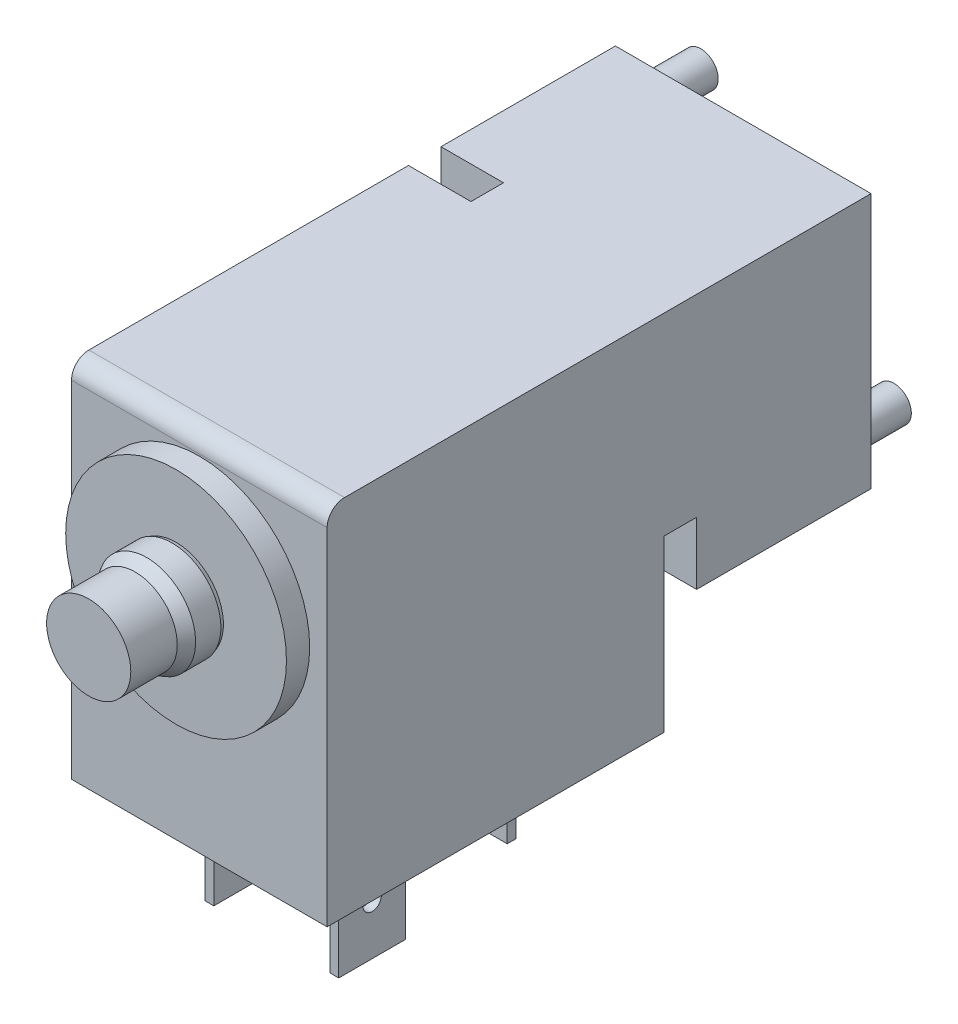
ISO-10303-21;
HEADER;
FILE_DESCRIPTION(('STEP AP214'),'2;1');
FILE_NAME('part.step','',(''),(''),'','','');
FILE_SCHEMA(('AUTOMOTIVE_DESIGN { 1 0 10303 214 1 1 1 1 }'));
ENDSEC;
DATA;
#1=APPLICATION_CONTEXT('core data for automotive mechanical design processes');
#2=APPLICATION_PROTOCOL_DEFINITION('international standard','automotive_design',2000,#1);
#3=PRODUCT_CONTEXT('',#1,'mechanical');
#4=PRODUCT('Part','Part','',(#3));
#5=PRODUCT_RELATED_PRODUCT_CATEGORY('part','',(#4));
#6=PRODUCT_DEFINITION_FORMATION('','',#4);
#7=PRODUCT_DEFINITION_CONTEXT('part definition',#1,'design');
#8=PRODUCT_DEFINITION('design','',#6,#7);
#9=PRODUCT_DEFINITION_SHAPE('','',#8);
#10=(LENGTH_UNIT() NAMED_UNIT(*) SI_UNIT(.MILLI.,.METRE.));
#11=(NAMED_UNIT(*) PLANE_ANGLE_UNIT() SI_UNIT($,.RADIAN.));
#12=(NAMED_UNIT(*) SI_UNIT($,.STERADIAN.) SOLID_ANGLE_UNIT());
#13=UNCERTAINTY_MEASURE_WITH_UNIT(LENGTH_MEASURE(1.E-05),#10,'distance_accuracy_value','');
#14=(GEOMETRIC_REPRESENTATION_CONTEXT(3) GLOBAL_UNCERTAINTY_ASSIGNED_CONTEXT((#13)) GLOBAL_UNIT_ASSIGNED_CONTEXT((#10,
#11,#12)) REPRESENTATION_CONTEXT('',''));
#15=CARTESIAN_POINT('',(0.,0.,0.));
#16=DIRECTION('',(0.,0.,1.));
#17=DIRECTION('',(1.,0.,0.));
#18=AXIS2_PLACEMENT_3D('',#15,#16,#17);
#19=CARTESIAN_POINT('',(11.,14.9150729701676,48.8100000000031));
#20=DIRECTION('',(0.,0.,-1.));
#21=DIRECTION('',(-1.,0.,0.));
#22=AXIS2_PLACEMENT_3D('',#19,#20,#21);
#23=PLANE('',#22);
#24=CARTESIAN_POINT('',(11.,10.8400000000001,48.8100000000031));
#25=DIRECTION('',(0.,0.,-1.));
#26=DIRECTION('',(-1.,0.,0.));
#27=AXIS2_PLACEMENT_3D('',#24,#25,#26);
#28=CIRCLE('',#27,4.07507297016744);
#29=CARTESIAN_POINT('',(6.92492702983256,10.8400000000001,48.8100000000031));
#30=VERTEX_POINT('',#29);
#31=EDGE_CURVE('P0_E9',#30,#30,#28,.T.);
#32=ORIENTED_EDGE('',*,*,#31,.T.);
#33=EDGE_LOOP('',(#32));
#34=FACE_BOUND('',#33,.T.);
#35=ADVANCED_FACE('P0_F14',(#34),#23,.T.);
#36=CARTESIAN_POINT('',(11.,10.8400000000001,48.8100000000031));
#37=DIRECTION('',(0.,0.,1.));
#38=DIRECTION('',(1.,0.,0.));
#39=AXIS2_PLACEMENT_3D('',#36,#37,#38);
#40=CONICAL_SURFACE('',#39,4.07507297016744,0.349065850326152);
#41=CARTESIAN_POINT('',(11.,10.8400000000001,49.1532341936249));
#42=DIRECTION('',(0.,0.,-1.));
#43=DIRECTION('',(-1.,0.,0.));
#44=AXIS2_PLACEMENT_3D('',#41,#42,#43);
#45=CIRCLE('',#44,4.19999999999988);
#46=CARTESIAN_POINT('',(6.80000000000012,10.8400000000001,49.1532341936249));
#47=VERTEX_POINT('',#46);
#48=EDGE_CURVE('P0_E20',#47,#47,#45,.T.);
#49=ORIENTED_EDGE('',*,*,#48,.T.);
#50=EDGE_LOOP('',(#49));
#51=FACE_BOUND('',#50,.T.);
#52=ORIENTED_EDGE('',*,*,#31,.F.);
#53=EDGE_LOOP('',(#52));
#54=FACE_BOUND('',#53,.T.);
#55=ADVANCED_FACE('P0_F54',(#51,#54),#40,.T.);
#56=CARTESIAN_POINT('',(11.,10.8400000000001,45.7723013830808));
#57=DIRECTION('',(0.,0.,-1.));
#58=DIRECTION('',(-1.,0.,0.));
#59=AXIS2_PLACEMENT_3D('',#56,#57,#58);
#60=CYLINDRICAL_SURFACE('',#59,4.19999999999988);
#61=CARTESIAN_POINT('',(11.,10.8400000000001,51.33));
#62=DIRECTION('',(0.,0.,-1.));
#63=DIRECTION('',(-1.,0.,0.));
#64=AXIS2_PLACEMENT_3D('',#61,#62,#63);
#65=CIRCLE('',#64,4.19999999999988);
#66=CARTESIAN_POINT('',(6.80000000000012,10.8400000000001,51.33));
#67=VERTEX_POINT('',#66);
#68=EDGE_CURVE('P0_E24',#67,#67,#65,.T.);
#69=ORIENTED_EDGE('',*,*,#68,.T.);
#70=EDGE_LOOP('',(#69));
#71=FACE_BOUND('',#70,.T.);
#72=ORIENTED_EDGE('',*,*,#48,.F.);
#73=EDGE_LOOP('',(#72));
#74=FACE_BOUND('',#73,.T.);
#75=ADVANCED_FACE('P0_F48',(#71,#74),#60,.T.);
#76=CARTESIAN_POINT('',(11.,10.8400000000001,51.33));
#77=DIRECTION('',(0.,0.,-1.));
#78=DIRECTION('',(-1.,0.,0.));
#79=AXIS2_PLACEMENT_3D('',#76,#77,#78);
#80=CONICAL_SURFACE('',#79,4.19999999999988,0.523598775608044);
#81=CARTESIAN_POINT('',(11.,10.8400000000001,52.3300000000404));
#82=DIRECTION('',(0.,0.,1.));
#83=DIRECTION('',(1.,0.,0.));
#84=AXIS2_PLACEMENT_3D('',#81,#82,#83);
#85=CIRCLE('',#84,3.62264973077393);
#86=CARTESIAN_POINT('',(14.6226497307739,10.8400000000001,52.3300000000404));
#87=VERTEX_POINT('',#86);
#88=EDGE_CURVE('P0_E31',#87,#87,#85,.T.);
#89=ORIENTED_EDGE('',*,*,#88,.F.);
#90=EDGE_LOOP('',(#89));
#91=FACE_BOUND('',#90,.T.);
#92=ORIENTED_EDGE('',*,*,#68,.F.);
#93=EDGE_LOOP('',(#92));
#94=FACE_BOUND('',#93,.T.);
#95=ADVANCED_FACE('P0_F42',(#91,#94),#80,.T.);
#96=CARTESIAN_POINT('',(11.,10.8400000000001,56.3300000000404));
#97=DIRECTION('',(0.,0.,-1.));
#98=DIRECTION('',(-1.,0.,0.));
#99=AXIS2_PLACEMENT_3D('',#96,#97,#98);
#100=CYLINDRICAL_SURFACE('',#99,3.62264973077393);
#101=CARTESIAN_POINT('',(11.,10.8400000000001,56.3300000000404));
#102=DIRECTION('',(0.,0.,1.));
#103=DIRECTION('',(1.,0.,0.));
#104=AXIS2_PLACEMENT_3D('',#101,#102,#103);
#105=CIRCLE('',#104,3.62264973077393);
#106=CARTESIAN_POINT('',(14.6226497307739,10.8400000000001,56.3300000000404));
#107=VERTEX_POINT('',#106);
#108=EDGE_CURVE('P0_E28',#107,#107,#105,.T.);
#109=ORIENTED_EDGE('',*,*,#108,.F.);
#110=EDGE_LOOP('',(#109));
#111=FACE_BOUND('',#110,.T.);
#112=ORIENTED_EDGE('',*,*,#88,.T.);
#113=EDGE_LOOP('',(#112));
#114=FACE_BOUND('',#113,.T.);
#115=ADVANCED_FACE('P0_F39',(#111,#114),#100,.T.);
#116=CARTESIAN_POINT('',(11.,10.8400000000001,56.3300000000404));
#117=DIRECTION('',(0.,0.,1.));
#118=DIRECTION('',(1.,0.,0.));
#119=AXIS2_PLACEMENT_3D('',#116,#117,#118);
#120=PLANE('',#119);
#121=ORIENTED_EDGE('',*,*,#108,.T.);
#122=EDGE_LOOP('',(#121));
#123=FACE_BOUND('',#122,.T.);
#124=ADVANCED_FACE('P0_F37',(#123),#120,.T.);
#125=CLOSED_SHELL('',(#35,#55,#75,#95,#115,#124));
#126=MANIFOLD_SOLID_BREP('P0_B1',#125);
#127=CARTESIAN_POINT('',(13.4999999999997,-6.74999999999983,31.8099999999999));
#128=DIRECTION('',(0.,-1.,0.));
#129=DIRECTION('',(1.,0.,0.));
#130=AXIS2_PLACEMENT_3D('',#127,#128,#129);
#131=PLANE('',#130);
#132=CARTESIAN_POINT('',(10.9999999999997,-6.74999999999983,31.8099999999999));
#133=DIRECTION('',(0.,1.,0.));
#134=DIRECTION('',(-1.,0.,0.));
#135=AXIS2_PLACEMENT_3D('',#132,#133,#134);
#136=CIRCLE('',#135,2.5);
#137=CARTESIAN_POINT('',(8.49999999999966,-6.74999999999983,31.8099999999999));
#138=VERTEX_POINT('',#137);
#139=EDGE_CURVE('P1_E20',#138,#138,#136,.F.);
#140=ORIENTED_EDGE('',*,*,#139,.T.);
#141=EDGE_LOOP('',(#140));
#142=FACE_BOUND('',#141,.T.);
#143=ADVANCED_FACE('P1_F17',(#142),#131,.T.);
#144=CARTESIAN_POINT('',(10.9999999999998,-14.5043798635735,22.5600000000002));
#145=DIRECTION('',(0.,0.,1.));
#146=DIRECTION('',(1.,0.,0.));
#147=AXIS2_PLACEMENT_3D('',#144,#145,#146);
#148=CYLINDRICAL_SURFACE('',#147,0.79);
#149=CARTESIAN_POINT('',(10.9999999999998,-14.5043798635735,22.5600000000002));
#150=DIRECTION('',(0.,0.,1.));
#151=DIRECTION('',(1.,0.,0.));
#152=AXIS2_PLACEMENT_3D('',#149,#150,#151);
#153=CIRCLE('',#152,0.79);
#154=CARTESIAN_POINT('',(11.7899999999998,-14.5043798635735,22.5600000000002));
#155=VERTEX_POINT('',#154);
#156=EDGE_CURVE('P1_E439',#155,#155,#153,.T.);
#157=ORIENTED_EDGE('',*,*,#156,.F.);
#158=EDGE_LOOP('',(#157));
#159=FACE_BOUND('',#158,.T.);
#160=CARTESIAN_POINT('',(10.9999999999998,-14.5043798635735,23.3100000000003));
#161=DIRECTION('',(0.,0.,1.));
#162=DIRECTION('',(1.,0.,0.));
#163=AXIS2_PLACEMENT_3D('',#160,#161,#162);
#164=CIRCLE('',#163,0.79);
#165=CARTESIAN_POINT('',(11.7899999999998,-14.5043798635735,23.3100000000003));
#166=VERTEX_POINT('',#165);
#167=EDGE_CURVE('P1_E443',#166,#166,#164,.F.);
#168=ORIENTED_EDGE('',*,*,#167,.F.);
#169=EDGE_LOOP('',(#168));
#170=FACE_BOUND('',#169,.T.);
#171=ADVANCED_FACE('P1_F725',(#159,#170),#148,.F.);
#172=CARTESIAN_POINT('',(7.99999999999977,-18.8099999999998,23.3100000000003));
#173=DIRECTION('',(0.,1.,0.));
#174=DIRECTION('',(0.,0.,1.));
#175=AXIS2_PLACEMENT_3D('',#172,#173,#174);
#176=PLANE('',#175);
#177=DIRECTION('',(0.,0.,1.));
#178=VECTOR('',#177,1.);
#179=CARTESIAN_POINT('',(7.99999999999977,-18.8099999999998,22.5600000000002));
#180=LINE('',#179,#178);
#181=CARTESIAN_POINT('',(7.99999999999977,-18.8099999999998,22.5600000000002));
#182=VERTEX_POINT('',#181);
#183=CARTESIAN_POINT('',(7.99999999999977,-18.8099999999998,23.3100000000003));
#184=VERTEX_POINT('',#183);
#185=EDGE_CURVE('P1_E393',#182,#184,#180,.T.);
#186=ORIENTED_EDGE('',*,*,#185,.F.);
#187=DIRECTION('',(-1.,0.,0.));
#188=VECTOR('',#187,1.);
#189=CARTESIAN_POINT('',(8.24999999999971,-18.8099999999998,22.5600000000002));
#190=LINE('',#189,#188);
#191=CARTESIAN_POINT('',(13.9999999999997,-18.8099999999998,22.5600000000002));
#192=VERTEX_POINT('',#191);
#193=EDGE_CURVE('P1_E441',#192,#182,#190,.T.);
#194=ORIENTED_EDGE('',*,*,#193,.F.);
#195=DIRECTION('',(0.,0.,1.));
#196=VECTOR('',#195,1.);
#197=CARTESIAN_POINT('',(13.9999999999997,-18.8099999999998,23.3100000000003));
#198=LINE('',#197,#196);
#199=CARTESIAN_POINT('',(13.9999999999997,-18.8099999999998,23.3100000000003));
#200=VERTEX_POINT('',#199);
#201=EDGE_CURVE('P1_E389',#200,#192,#198,.F.);
#202=ORIENTED_EDGE('',*,*,#201,.F.);
#203=DIRECTION('',(1.,0.,0.));
#204=VECTOR('',#203,1.);
#205=CARTESIAN_POINT('',(10.9999999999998,-18.8099999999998,23.3100000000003));
#206=LINE('',#205,#204);
#207=EDGE_CURVE('P1_E445',#184,#200,#206,.T.);
#208=ORIENTED_EDGE('',*,*,#207,.F.);
#209=EDGE_LOOP('',(#186,#194,#202,#208));
#210=FACE_BOUND('',#209,.T.);
#211=ADVANCED_FACE('P1_F722',(#210),#176,.F.);
#212=CARTESIAN_POINT('',(7.99999999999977,-9.24999999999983,22.5600000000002));
#213=DIRECTION('',(-1.,0.,0.));
#214=DIRECTION('',(0.,-1.,0.));
#215=AXIS2_PLACEMENT_3D('',#212,#213,#214);
#216=PLANE('',#215);
#217=DIRECTION('',(0.,0.,1.));
#218=VECTOR('',#217,1.);
#219=CARTESIAN_POINT('',(7.99999999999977,-9.24999999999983,22.5600000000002));
#220=LINE('',#219,#218);
#221=CARTESIAN_POINT('',(7.99999999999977,-9.24999999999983,23.3100000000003));
#222=VERTEX_POINT('',#221);
#223=CARTESIAN_POINT('',(7.99999999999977,-9.24999999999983,22.5600000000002));
#224=VERTEX_POINT('',#223);
#225=EDGE_CURVE('P1_E391',#222,#224,#220,.F.);
#226=ORIENTED_EDGE('',*,*,#225,.T.);
#227=DIRECTION('',(0.,1.,0.));
#228=VECTOR('',#227,1.);
#229=CARTESIAN_POINT('',(7.99999999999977,-9.24999999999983,22.5600000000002));
#230=LINE('',#229,#228);
#231=EDGE_CURVE('P1_E578',#182,#224,#230,.T.);
#232=ORIENTED_EDGE('',*,*,#231,.F.);
#233=ORIENTED_EDGE('',*,*,#185,.T.);
#234=DIRECTION('',(0.,1.,0.));
#235=VECTOR('',#234,1.);
#236=CARTESIAN_POINT('',(7.99999999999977,-9.24999999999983,23.3100000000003));
#237=LINE('',#236,#235);
#238=EDGE_CURVE('P1_E442',#222,#184,#237,.F.);
#239=ORIENTED_EDGE('',*,*,#238,.F.);
#240=EDGE_LOOP('',(#226,#232,#233,#239));
#241=FACE_BOUND('',#240,.T.);
#242=ADVANCED_FACE('P1_F718',(#241),#216,.T.);
#243=CARTESIAN_POINT('',(13.9999999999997,-9.24999999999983,23.3100000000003));
#244=DIRECTION('',(1.,0.,0.));
#245=DIRECTION('',(0.,1.,0.));
#246=AXIS2_PLACEMENT_3D('',#243,#244,#245);
#247=PLANE('',#246);
#248=DIRECTION('',(0.,0.,1.));
#249=VECTOR('',#248,1.);
#250=CARTESIAN_POINT('',(13.9999999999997,-9.24999999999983,23.3100000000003));
#251=LINE('',#250,#249);
#252=CARTESIAN_POINT('',(13.9999999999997,-9.24999999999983,22.5600000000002));
#253=VERTEX_POINT('',#252);
#254=CARTESIAN_POINT('',(13.9999999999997,-9.24999999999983,23.3100000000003));
#255=VERTEX_POINT('',#254);
#256=EDGE_CURVE('P1_E387',#253,#255,#251,.T.);
#257=ORIENTED_EDGE('',*,*,#256,.T.);
#258=DIRECTION('',(0.,1.,0.));
#259=VECTOR('',#258,1.);
#260=CARTESIAN_POINT('',(13.9999999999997,-9.24999999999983,23.3100000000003));
#261=LINE('',#260,#259);
#262=EDGE_CURVE('P1_E448',#200,#255,#261,.T.);
#263=ORIENTED_EDGE('',*,*,#262,.F.);
#264=ORIENTED_EDGE('',*,*,#201,.T.);
#265=DIRECTION('',(0.,1.,0.));
#266=VECTOR('',#265,1.);
#267=CARTESIAN_POINT('',(13.9999999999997,-9.24999999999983,22.5600000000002));
#268=LINE('',#267,#266);
#269=EDGE_CURVE('P1_E438',#253,#192,#268,.F.);
#270=ORIENTED_EDGE('',*,*,#269,.F.);
#271=EDGE_LOOP('',(#257,#263,#264,#270));
#272=FACE_BOUND('',#271,.T.);
#273=ADVANCED_FACE('P1_F714',(#272),#247,.T.);
#274=CARTESIAN_POINT('',(5.24999999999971,-14.5043798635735,37.6850000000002));
#275=DIRECTION('',(1.,0.,0.));
#276=DIRECTION('',(0.,1.,0.));
#277=AXIS2_PLACEMENT_3D('',#274,#275,#276);
#278=CYLINDRICAL_SURFACE('',#277,0.79);
#279=CARTESIAN_POINT('',(16.7499999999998,-14.5043798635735,37.6850000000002));
#280=DIRECTION('',(1.,0.,0.));
#281=DIRECTION('',(0.,1.,0.));
#282=AXIS2_PLACEMENT_3D('',#279,#280,#281);
#283=CIRCLE('',#282,0.79);
#284=CARTESIAN_POINT('',(16.7499999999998,-13.7143798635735,37.6850000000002));
#285=VERTEX_POINT('',#284);
#286=EDGE_CURVE('P1_E434',#285,#285,#283,.F.);
#287=ORIENTED_EDGE('',*,*,#286,.F.);
#288=EDGE_LOOP('',(#287));
#289=FACE_BOUND('',#288,.T.);
#290=CARTESIAN_POINT('',(15.9999999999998,-14.5043798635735,37.6850000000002));
#291=DIRECTION('',(1.,0.,0.));
#292=DIRECTION('',(0.,1.,0.));
#293=AXIS2_PLACEMENT_3D('',#290,#291,#292);
#294=CIRCLE('',#293,0.79);
#295=CARTESIAN_POINT('',(15.9999999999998,-13.7143798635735,37.6850000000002));
#296=VERTEX_POINT('',#295);
#297=EDGE_CURVE('P1_E429',#296,#296,#294,.T.);
#298=ORIENTED_EDGE('',*,*,#297,.F.);
#299=EDGE_LOOP('',(#298));
#300=FACE_BOUND('',#299,.T.);
#301=ADVANCED_FACE('P1_F710',(#289,#300),#278,.F.);
#302=CARTESIAN_POINT('',(15.9999999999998,-18.8099999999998,40.5600000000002));
#303=DIRECTION('',(0.,1.,0.));
#304=DIRECTION('',(0.,0.,1.));
#305=AXIS2_PLACEMENT_3D('',#302,#303,#304);
#306=PLANE('',#305);
#307=DIRECTION('',(0.,0.,1.));
#308=VECTOR('',#307,1.);
#309=CARTESIAN_POINT('',(15.9999999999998,-18.8099999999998,34.8100000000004));
#310=LINE('',#309,#308);
#311=CARTESIAN_POINT('',(15.9999999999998,-18.8099999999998,34.8100000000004));
#312=VERTEX_POINT('',#311);
#313=CARTESIAN_POINT('',(15.9999999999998,-18.8099999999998,40.5600000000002));
#314=VERTEX_POINT('',#313);
#315=EDGE_CURVE('P1_E432',#312,#314,#310,.T.);
#316=ORIENTED_EDGE('',*,*,#315,.F.);
#317=DIRECTION('',(-1.,0.,0.));
#318=VECTOR('',#317,1.);
#319=CARTESIAN_POINT('',(16.7499999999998,-18.8099999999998,34.8100000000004));
#320=LINE('',#319,#318);
#321=CARTESIAN_POINT('',(16.7499999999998,-18.8099999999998,34.8100000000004));
#322=VERTEX_POINT('',#321);
#323=EDGE_CURVE('P1_E381',#322,#312,#320,.T.);
#324=ORIENTED_EDGE('',*,*,#323,.F.);
#325=DIRECTION('',(0.,0.,1.));
#326=VECTOR('',#325,1.);
#327=CARTESIAN_POINT('',(16.7499999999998,-18.8099999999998,40.5600000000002));
#328=LINE('',#327,#326);
#329=CARTESIAN_POINT('',(16.7499999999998,-18.8099999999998,40.5600000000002));
#330=VERTEX_POINT('',#329);
#331=EDGE_CURVE('P1_E437',#330,#322,#328,.F.);
#332=ORIENTED_EDGE('',*,*,#331,.F.);
#333=DIRECTION('',(1.,0.,0.));
#334=VECTOR('',#333,1.);
#335=CARTESIAN_POINT('',(15.9999999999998,-18.8099999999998,40.5600000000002));
#336=LINE('',#335,#334);
#337=EDGE_CURVE('P1_E385',#314,#330,#336,.T.);
#338=ORIENTED_EDGE('',*,*,#337,.F.);
#339=EDGE_LOOP('',(#316,#324,#332,#338));
#340=FACE_BOUND('',#339,.T.);
#341=ADVANCED_FACE('P1_F706',(#340),#306,.F.);
#342=CARTESIAN_POINT('',(15.9999999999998,-9.24999999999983,40.5600000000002));
#343=DIRECTION('',(0.,0.,1.));
#344=DIRECTION('',(1.,0.,0.));
#345=AXIS2_PLACEMENT_3D('',#342,#343,#344);
#346=PLANE('',#345);
#347=DIRECTION('',(1.,0.,0.));
#348=VECTOR('',#347,1.);
#349=CARTESIAN_POINT('',(15.9999999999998,-9.24999999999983,40.5600000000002));
#350=LINE('',#349,#348);
#351=CARTESIAN_POINT('',(16.7499999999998,-9.24999999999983,40.5600000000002));
#352=VERTEX_POINT('',#351);
#353=CARTESIAN_POINT('',(15.9999999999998,-9.24999999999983,40.5600000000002));
#354=VERTEX_POINT('',#353);
#355=EDGE_CURVE('P1_E383',#352,#354,#350,.F.);
#356=ORIENTED_EDGE('',*,*,#355,.T.);
#357=DIRECTION('',(0.,-1.,0.));
#358=VECTOR('',#357,1.);
#359=CARTESIAN_POINT('',(15.9999999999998,-9.24999999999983,40.5600000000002));
#360=LINE('',#359,#358);
#361=EDGE_CURVE('P1_E590',#314,#354,#360,.F.);
#362=ORIENTED_EDGE('',*,*,#361,.F.);
#363=ORIENTED_EDGE('',*,*,#337,.T.);
#364=DIRECTION('',(0.,1.,0.));
#365=VECTOR('',#364,1.);
#366=CARTESIAN_POINT('',(16.7499999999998,-9.24999999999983,40.5600000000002));
#367=LINE('',#366,#365);
#368=EDGE_CURVE('P1_E433',#352,#330,#367,.F.);
#369=ORIENTED_EDGE('',*,*,#368,.F.);
#370=EDGE_LOOP('',(#356,#362,#363,#369));
#371=FACE_BOUND('',#370,.T.);
#372=ADVANCED_FACE('P1_F702',(#371),#346,.T.);
#373=CARTESIAN_POINT('',(16.7499999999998,-9.24999999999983,34.8100000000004));
#374=DIRECTION('',(0.,0.,-1.));
#375=DIRECTION('',(-1.,0.,0.));
#376=AXIS2_PLACEMENT_3D('',#373,#374,#375);
#377=PLANE('',#376);
#378=DIRECTION('',(-1.,0.,0.));
#379=VECTOR('',#378,1.);
#380=CARTESIAN_POINT('',(16.7499999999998,-9.24999999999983,34.8100000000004));
#381=LINE('',#380,#379);
#382=CARTESIAN_POINT('',(15.9999999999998,-9.24999999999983,34.8100000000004));
#383=VERTEX_POINT('',#382);
#384=CARTESIAN_POINT('',(16.7499999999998,-9.24999999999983,34.8100000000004));
#385=VERTEX_POINT('',#384);
#386=EDGE_CURVE('P1_E379',#383,#385,#381,.F.);
#387=ORIENTED_EDGE('',*,*,#386,.T.);
#388=DIRECTION('',(0.,1.,0.));
#389=VECTOR('',#388,1.);
#390=CARTESIAN_POINT('',(16.7499999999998,-9.24999999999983,34.8100000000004));
#391=LINE('',#390,#389);
#392=EDGE_CURVE('P1_E584',#322,#385,#391,.T.);
#393=ORIENTED_EDGE('',*,*,#392,.F.);
#394=ORIENTED_EDGE('',*,*,#323,.T.);
#395=DIRECTION('',(0.,-1.,0.));
#396=VECTOR('',#395,1.);
#397=CARTESIAN_POINT('',(15.9999999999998,-9.24999999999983,34.8100000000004));
#398=LINE('',#397,#396);
#399=EDGE_CURVE('P1_E428',#383,#312,#398,.T.);
#400=ORIENTED_EDGE('',*,*,#399,.F.);
#401=EDGE_LOOP('',(#387,#393,#394,#400));
#402=FACE_BOUND('',#401,.T.);
#403=ADVANCED_FACE('P1_F698',(#402),#377,.T.);
#404=CARTESIAN_POINT('',(5.24999999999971,-14.5043798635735,37.6850000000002));
#405=DIRECTION('',(1.,0.,0.));
#406=DIRECTION('',(0.,1.,0.));
#407=AXIS2_PLACEMENT_3D('',#404,#405,#406);
#408=CYLINDRICAL_SURFACE('',#407,0.79);
#409=CARTESIAN_POINT('',(5.24999999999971,-14.5043798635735,37.6850000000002));
#410=DIRECTION('',(1.,0.,0.));
#411=DIRECTION('',(0.,1.,0.));
#412=AXIS2_PLACEMENT_3D('',#409,#410,#411);
#413=CIRCLE('',#412,0.79);
#414=CARTESIAN_POINT('',(5.24999999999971,-13.7143798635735,37.6850000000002));
#415=VERTEX_POINT('',#414);
#416=EDGE_CURVE('P1_E424',#415,#415,#413,.T.);
#417=ORIENTED_EDGE('',*,*,#416,.F.);
#418=EDGE_LOOP('',(#417));
#419=FACE_BOUND('',#418,.T.);
#420=CARTESIAN_POINT('',(5.99999999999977,-14.5043798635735,37.6850000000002));
#421=DIRECTION('',(1.,0.,0.));
#422=DIRECTION('',(0.,1.,0.));
#423=AXIS2_PLACEMENT_3D('',#420,#421,#422);
#424=CIRCLE('',#423,0.79);
#425=CARTESIAN_POINT('',(5.99999999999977,-13.7143798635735,37.6850000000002));
#426=VERTEX_POINT('',#425);
#427=EDGE_CURVE('P1_E419',#426,#426,#424,.F.);
#428=ORIENTED_EDGE('',*,*,#427,.F.);
#429=EDGE_LOOP('',(#428));
#430=FACE_BOUND('',#429,.T.);
#431=ADVANCED_FACE('P1_F694',(#419,#430),#408,.F.);
#432=CARTESIAN_POINT('',(5.24999999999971,-18.8099999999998,34.8100000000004));
#433=DIRECTION('',(0.,-1.,0.));
#434=DIRECTION('',(1.,0.,0.));
#435=AXIS2_PLACEMENT_3D('',#432,#433,#434);
#436=PLANE('',#435);
#437=DIRECTION('',(0.,0.,1.));
#438=VECTOR('',#437,1.);
#439=CARTESIAN_POINT('',(5.99999999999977,-18.8099999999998,40.5600000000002));
#440=LINE('',#439,#438);
#441=CARTESIAN_POINT('',(5.99999999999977,-18.8099999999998,40.5600000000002));
#442=VERTEX_POINT('',#441);
#443=CARTESIAN_POINT('',(5.99999999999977,-18.8099999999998,34.8100000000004));
#444=VERTEX_POINT('',#443);
#445=EDGE_CURVE('P1_E422',#442,#444,#440,.F.);
#446=ORIENTED_EDGE('',*,*,#445,.F.);
#447=DIRECTION('',(1.,0.,0.));
#448=VECTOR('',#447,1.);
#449=CARTESIAN_POINT('',(5.24999999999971,-18.8099999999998,40.5600000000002));
#450=LINE('',#449,#448);
#451=CARTESIAN_POINT('',(5.24999999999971,-18.8099999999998,40.5600000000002));
#452=VERTEX_POINT('',#451);
#453=EDGE_CURVE('P1_E373',#452,#442,#450,.T.);
#454=ORIENTED_EDGE('',*,*,#453,.F.);
#455=DIRECTION('',(0.,0.,1.));
#456=VECTOR('',#455,1.);
#457=CARTESIAN_POINT('',(5.24999999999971,-18.8099999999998,34.8100000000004));
#458=LINE('',#457,#456);
#459=CARTESIAN_POINT('',(5.24999999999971,-18.8099999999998,34.8100000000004));
#460=VERTEX_POINT('',#459);
#461=EDGE_CURVE('P1_E427',#460,#452,#458,.T.);
#462=ORIENTED_EDGE('',*,*,#461,.F.);
#463=DIRECTION('',(-1.,0.,0.));
#464=VECTOR('',#463,1.);
#465=CARTESIAN_POINT('',(5.99999999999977,-18.8099999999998,34.8100000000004));
#466=LINE('',#465,#464);
#467=EDGE_CURVE('P1_E377',#444,#460,#466,.T.);
#468=ORIENTED_EDGE('',*,*,#467,.F.);
#469=EDGE_LOOP('',(#446,#454,#462,#468));
#470=FACE_BOUND('',#469,.T.);
#471=ADVANCED_FACE('P1_F688',(#470),#436,.T.);
#472=CARTESIAN_POINT('',(5.99999999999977,-9.24999999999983,34.8100000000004));
#473=DIRECTION('',(0.,0.,-1.));
#474=DIRECTION('',(-1.,0.,0.));
#475=AXIS2_PLACEMENT_3D('',#472,#473,#474);
#476=PLANE('',#475);
#477=DIRECTION('',(-1.,0.,0.));
#478=VECTOR('',#477,1.);
#479=CARTESIAN_POINT('',(5.99999999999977,-9.24999999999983,34.8100000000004));
#480=LINE('',#479,#478);
#481=CARTESIAN_POINT('',(5.24999999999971,-9.24999999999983,34.8100000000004));
#482=VERTEX_POINT('',#481);
#483=CARTESIAN_POINT('',(5.99999999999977,-9.24999999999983,34.8100000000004));
#484=VERTEX_POINT('',#483);
#485=EDGE_CURVE('P1_E375',#482,#484,#480,.F.);
#486=ORIENTED_EDGE('',*,*,#485,.T.);
#487=DIRECTION('',(0.,1.,0.));
#488=VECTOR('',#487,1.);
#489=CARTESIAN_POINT('',(5.99999999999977,-9.24999999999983,34.8100000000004));
#490=LINE('',#489,#488);
#491=EDGE_CURVE('P1_E602',#444,#484,#490,.T.);
#492=ORIENTED_EDGE('',*,*,#491,.F.);
#493=ORIENTED_EDGE('',*,*,#467,.T.);
#494=DIRECTION('',(0.,-1.,0.));
#495=VECTOR('',#494,1.);
#496=CARTESIAN_POINT('',(5.24999999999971,-9.24999999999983,34.8100000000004));
#497=LINE('',#496,#495);
#498=EDGE_CURVE('P1_E423',#482,#460,#497,.T.);
#499=ORIENTED_EDGE('',*,*,#498,.F.);
#500=EDGE_LOOP('',(#486,#492,#493,#499));
#501=FACE_BOUND('',#500,.T.);
#502=ADVANCED_FACE('P1_F683',(#501),#476,.T.);
#503=CARTESIAN_POINT('',(5.24999999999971,-9.24999999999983,40.5600000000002));
#504=DIRECTION('',(0.,0.,1.));
#505=DIRECTION('',(1.,0.,0.));
#506=AXIS2_PLACEMENT_3D('',#503,#504,#505);
#507=PLANE('',#506);
#508=DIRECTION('',(1.,0.,0.));
#509=VECTOR('',#508,1.);
#510=CARTESIAN_POINT('',(5.24999999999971,-9.24999999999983,40.5600000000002));
#511=LINE('',#510,#509);
#512=CARTESIAN_POINT('',(5.99999999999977,-9.24999999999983,40.5600000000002));
#513=VERTEX_POINT('',#512);
#514=CARTESIAN_POINT('',(5.24999999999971,-9.24999999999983,40.5600000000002));
#515=VERTEX_POINT('',#514);
#516=EDGE_CURVE('P1_E371',#513,#515,#511,.F.);
#517=ORIENTED_EDGE('',*,*,#516,.T.);
#518=DIRECTION('',(0.,-1.,0.));
#519=VECTOR('',#518,1.);
#520=CARTESIAN_POINT('',(5.24999999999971,-9.24999999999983,40.5600000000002));
#521=LINE('',#520,#519);
#522=EDGE_CURVE('P1_E596',#452,#515,#521,.F.);
#523=ORIENTED_EDGE('',*,*,#522,.F.);
#524=ORIENTED_EDGE('',*,*,#453,.T.);
#525=DIRECTION('',(0.,1.,0.));
#526=VECTOR('',#525,1.);
#527=CARTESIAN_POINT('',(5.99999999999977,-9.24999999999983,40.5600000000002));
#528=LINE('',#527,#526);
#529=EDGE_CURVE('P1_E418',#513,#442,#528,.F.);
#530=ORIENTED_EDGE('',*,*,#529,.F.);
#531=EDGE_LOOP('',(#517,#523,#524,#530));
#532=FACE_BOUND('',#531,.T.);
#533=ADVANCED_FACE('P1_F679',(#532),#507,.T.);
#534=CARTESIAN_POINT('',(11.,17.6275364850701,48.8099999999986));
#535=DIRECTION('',(0.,0.,1.));
#536=DIRECTION('',(1.,0.,0.));
#537=AXIS2_PLACEMENT_3D('',#534,#535,#536);
#538=PLANE('',#537);
#539=CARTESIAN_POINT('',(11.,10.8400000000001,48.8099999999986));
#540=DIRECTION('',(0.,0.,-1.));
#541=DIRECTION('',(-1.,0.,0.));
#542=AXIS2_PLACEMENT_3D('',#539,#540,#541);
#543=CIRCLE('',#542,9.5);
#544=CARTESIAN_POINT('',(1.5,10.8400000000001,48.8099999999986));
#545=VERTEX_POINT('',#544);
#546=EDGE_CURVE('P1_E415',#545,#545,#543,.T.);
#547=ORIENTED_EDGE('',*,*,#546,.F.);
#548=EDGE_LOOP('',(#547));
#549=FACE_BOUND('',#548,.T.);
#550=ADVANCED_FACE('P1_F547',(#549),#538,.T.);
#551=CARTESIAN_POINT('',(11.,6.97044066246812,-0.371580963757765));
#552=DIRECTION('',(0.,0.,-1.));
#553=DIRECTION('',(-1.,0.,0.));
#554=AXIS2_PLACEMENT_3D('',#551,#552,#553);
#555=PLANE('',#554);
#556=CARTESIAN_POINT('',(11.,11.0000000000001,-0.371580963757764));
#557=DIRECTION('',(0.,0.,1.));
#558=DIRECTION('',(0.,-1.,0.));
#559=AXIS2_PLACEMENT_3D('',#556,#557,#558);
#560=CIRCLE('',#559,8.05911867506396);
#561=CARTESIAN_POINT('',(11.,2.94088132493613,-0.371580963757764));
#562=VERTEX_POINT('',#561);
#563=EDGE_CURVE('P1_E414',#562,#562,#560,.T.);
#564=ORIENTED_EDGE('',*,*,#563,.F.);
#565=EDGE_LOOP('',(#564));
#566=FACE_BOUND('',#565,.T.);
#567=ADVANCED_FACE('P1_F540',(#566),#555,.T.);
#568=CARTESIAN_POINT('',(2.69000000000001,17.8100000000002,-4.66));
#569=DIRECTION('',(0.,0.,1.));
#570=DIRECTION('',(1.,0.,0.));
#571=AXIS2_PLACEMENT_3D('',#568,#569,#570);
#572=PLANE('',#571);
#573=CARTESIAN_POINT('',(2.69000000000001,19.3100000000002,-4.66));
#574=DIRECTION('',(0.,0.,-1.));
#575=DIRECTION('',(-1.,0.,0.));
#576=AXIS2_PLACEMENT_3D('',#573,#574,#575);
#577=CIRCLE('',#576,1.5);
#578=CARTESIAN_POINT('',(1.19000000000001,19.3100000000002,-4.66));
#579=VERTEX_POINT('',#578);
#580=EDGE_CURVE('P1_E411',#579,#579,#577,.F.);
#581=ORIENTED_EDGE('',*,*,#580,.F.);
#582=EDGE_LOOP('',(#581));
#583=FACE_BOUND('',#582,.T.);
#584=ADVANCED_FACE('P1_F535',(#583),#572,.F.);
#585=CARTESIAN_POINT('',(19.31,1.19,-4.66));
#586=DIRECTION('',(0.,0.,1.));
#587=DIRECTION('',(1.,0.,0.));
#588=AXIS2_PLACEMENT_3D('',#585,#586,#587);
#589=PLANE('',#588);
#590=CARTESIAN_POINT('',(19.31,2.69,-4.66));
#591=DIRECTION('',(0.,0.,-1.));
#592=DIRECTION('',(-1.,0.,0.));
#593=AXIS2_PLACEMENT_3D('',#590,#591,#592);
#594=CIRCLE('',#593,1.5);
#595=CARTESIAN_POINT('',(17.81,2.69,-4.66));
#596=VERTEX_POINT('',#595);
#597=EDGE_CURVE('P1_E407',#596,#596,#594,.F.);
#598=ORIENTED_EDGE('',*,*,#597,.F.);
#599=EDGE_LOOP('',(#598));
#600=FACE_BOUND('',#599,.T.);
#601=ADVANCED_FACE('P1_F468',(#600),#589,.F.);
#602=CARTESIAN_POINT('',(0.,16.6200000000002,17.81));
#603=DIRECTION('',(0.,-1.,0.));
#604=DIRECTION('',(1.,0.,0.));
#605=AXIS2_PLACEMENT_3D('',#602,#603,#604);
#606=PLANE('',#605);
#607=DIRECTION('',(0.,0.,1.));
#608=VECTOR('',#607,1.);
#609=CARTESIAN_POINT('',(0.,16.6200000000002,8.905));
#610=LINE('',#609,#608);
#611=CARTESIAN_POINT('',(0.,16.6200000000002,15.01));
#612=VERTEX_POINT('',#611);
#613=CARTESIAN_POINT('',(0.,16.6200000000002,17.81));
#614=VERTEX_POINT('',#613);
#615=EDGE_CURVE('P1_E567',#612,#614,#610,.T.);
#616=ORIENTED_EDGE('',*,*,#615,.T.);
#617=DIRECTION('',(-1.,0.,0.));
#618=VECTOR('',#617,1.);
#619=CARTESIAN_POINT('',(0.,16.6200000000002,17.81));
#620=LINE('',#619,#618);
#621=CARTESIAN_POINT('',(5.38,16.6200000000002,17.81));
#622=VERTEX_POINT('',#621);
#623=EDGE_CURVE('P1_E562',#622,#614,#620,.T.);
#624=ORIENTED_EDGE('',*,*,#623,.F.);
#625=DIRECTION('',(0.,0.,1.));
#626=VECTOR('',#625,1.);
#627=CARTESIAN_POINT('',(5.38,16.6200000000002,17.81));
#628=LINE('',#627,#626);
#629=CARTESIAN_POINT('',(5.38,16.6200000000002,15.01));
#630=VERTEX_POINT('',#629);
#631=EDGE_CURVE('P1_E359',#622,#630,#628,.F.);
#632=ORIENTED_EDGE('',*,*,#631,.T.);
#633=DIRECTION('',(-1.,0.,0.));
#634=VECTOR('',#633,1.);
#635=CARTESIAN_POINT('',(0.,16.6200000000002,15.01));
#636=LINE('',#635,#634);
#637=EDGE_CURVE('P1_E368',#630,#612,#636,.T.);
#638=ORIENTED_EDGE('',*,*,#637,.T.);
#639=EDGE_LOOP('',(#616,#624,#632,#638));
#640=FACE_BOUND('',#639,.T.);
#641=ADVANCED_FACE('P1_F457',(#640),#606,.F.);
#642=CARTESIAN_POINT('',(10.9999999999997,-9.24999999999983,31.8099999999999));
#643=DIRECTION('',(0.,1.,0.));
#644=DIRECTION('',(-1.,0.,0.));
#645=AXIS2_PLACEMENT_3D('',#642,#643,#644);
#646=CYLINDRICAL_SURFACE('',#645,2.5);
#647=CARTESIAN_POINT('',(10.9999999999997,-9.24999999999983,31.8099999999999));
#648=DIRECTION('',(0.,1.,0.));
#649=DIRECTION('',(-1.,0.,0.));
#650=AXIS2_PLACEMENT_3D('',#647,#648,#649);
#651=CIRCLE('',#650,2.5);
#652=CARTESIAN_POINT('',(8.49999999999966,-9.24999999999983,31.8099999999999));
#653=VERTEX_POINT('',#652);
#654=EDGE_CURVE('P1_E267',#653,#653,#651,.T.);
#655=ORIENTED_EDGE('',*,*,#654,.F.);
#656=EDGE_LOOP('',(#655));
#657=FACE_BOUND('',#656,.T.);
#658=ORIENTED_EDGE('',*,*,#139,.F.);
#659=EDGE_LOOP('',(#658));
#660=FACE_BOUND('',#659,.T.);
#661=ADVANCED_FACE('P1_F454',(#657,#660),#646,.F.);
#662=CARTESIAN_POINT('',(10.9999999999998,-9.24999999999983,23.3100000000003));
#663=DIRECTION('',(0.,0.,1.));
#664=DIRECTION('',(1.,0.,0.));
#665=AXIS2_PLACEMENT_3D('',#662,#663,#664);
#666=PLANE('',#665);
#667=DIRECTION('',(1.,0.,0.));
#668=VECTOR('',#667,1.);
#669=CARTESIAN_POINT('',(0.,-9.24999999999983,23.3100000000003));
#670=LINE('',#669,#668);
#671=EDGE_CURVE('P1_E264',#222,#255,#670,.T.);
#672=ORIENTED_EDGE('',*,*,#671,.F.);
#673=ORIENTED_EDGE('',*,*,#238,.T.);
#674=ORIENTED_EDGE('',*,*,#207,.T.);
#675=ORIENTED_EDGE('',*,*,#262,.T.);
#676=EDGE_LOOP('',(#672,#673,#674,#675));
#677=FACE_BOUND('',#676,.T.);
#678=ORIENTED_EDGE('',*,*,#167,.T.);
#679=EDGE_LOOP('',(#678));
#680=FACE_BOUND('',#679,.T.);
#681=ADVANCED_FACE('P1_F456',(#677,#680),#666,.T.);
#682=CARTESIAN_POINT('',(8.24999999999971,-9.24999999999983,22.5600000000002));
#683=DIRECTION('',(0.,0.,-1.));
#684=DIRECTION('',(-1.,0.,0.));
#685=AXIS2_PLACEMENT_3D('',#682,#683,#684);
#686=PLANE('',#685);
#687=DIRECTION('',(1.,0.,0.));
#688=VECTOR('',#687,1.);
#689=CARTESIAN_POINT('',(0.,-9.24999999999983,22.5600000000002));
#690=LINE('',#689,#688);
#691=EDGE_CURVE('P1_E261',#253,#224,#690,.F.);
#692=ORIENTED_EDGE('',*,*,#691,.F.);
#693=ORIENTED_EDGE('',*,*,#269,.T.);
#694=ORIENTED_EDGE('',*,*,#193,.T.);
#695=ORIENTED_EDGE('',*,*,#231,.T.);
#696=EDGE_LOOP('',(#692,#693,#694,#695));
#697=FACE_BOUND('',#696,.T.);
#698=ORIENTED_EDGE('',*,*,#156,.T.);
#699=EDGE_LOOP('',(#698));
#700=FACE_BOUND('',#699,.T.);
#701=ADVANCED_FACE('P1_F465',(#697,#700),#686,.T.);
#702=CARTESIAN_POINT('',(16.7499999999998,-9.24999999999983,40.5600000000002));
#703=DIRECTION('',(1.,0.,0.));
#704=DIRECTION('',(0.,1.,0.));
#705=AXIS2_PLACEMENT_3D('',#702,#703,#704);
#706=PLANE('',#705);
#707=DIRECTION('',(0.,0.,1.));
#708=VECTOR('',#707,1.);
#709=CARTESIAN_POINT('',(16.7499999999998,-9.24999999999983,17.81));
#710=LINE('',#709,#708);
#711=EDGE_CURVE('P1_E258',#352,#385,#710,.F.);
#712=ORIENTED_EDGE('',*,*,#711,.F.);
#713=ORIENTED_EDGE('',*,*,#368,.T.);
#714=ORIENTED_EDGE('',*,*,#331,.T.);
#715=ORIENTED_EDGE('',*,*,#392,.T.);
#716=EDGE_LOOP('',(#712,#713,#714,#715));
#717=FACE_BOUND('',#716,.T.);
#718=ORIENTED_EDGE('',*,*,#286,.T.);
#719=EDGE_LOOP('',(#718));
#720=FACE_BOUND('',#719,.T.);
#721=ADVANCED_FACE('P1_F736',(#717,#720),#706,.T.);
#722=CARTESIAN_POINT('',(15.9999999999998,-9.24999999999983,34.8100000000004));
#723=DIRECTION('',(-1.,0.,0.));
#724=DIRECTION('',(0.,-1.,0.));
#725=AXIS2_PLACEMENT_3D('',#722,#723,#724);
#726=PLANE('',#725);
#727=DIRECTION('',(0.,0.,1.));
#728=VECTOR('',#727,1.);
#729=CARTESIAN_POINT('',(15.9999999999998,-9.24999999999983,17.81));
#730=LINE('',#729,#728);
#731=EDGE_CURVE('P1_E255',#383,#354,#730,.T.);
#732=ORIENTED_EDGE('',*,*,#731,.F.);
#733=ORIENTED_EDGE('',*,*,#399,.T.);
#734=ORIENTED_EDGE('',*,*,#315,.T.);
#735=ORIENTED_EDGE('',*,*,#361,.T.);
#736=EDGE_LOOP('',(#732,#733,#734,#735));
#737=FACE_BOUND('',#736,.T.);
#738=ORIENTED_EDGE('',*,*,#297,.T.);
#739=EDGE_LOOP('',(#738));
#740=FACE_BOUND('',#739,.T.);
#741=ADVANCED_FACE('P1_F742',(#737,#740),#726,.T.);
#742=CARTESIAN_POINT('',(5.24999999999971,-9.24999999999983,34.8100000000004));
#743=DIRECTION('',(-1.,0.,0.));
#744=DIRECTION('',(0.,-1.,0.));
#745=AXIS2_PLACEMENT_3D('',#742,#743,#744);
#746=PLANE('',#745);
#747=DIRECTION('',(0.,0.,1.));
#748=VECTOR('',#747,1.);
#749=CARTESIAN_POINT('',(5.24999999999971,-9.24999999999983,17.81));
#750=LINE('',#749,#748);
#751=EDGE_CURVE('P1_E252',#482,#515,#750,.T.);
#752=ORIENTED_EDGE('',*,*,#751,.F.);
#753=ORIENTED_EDGE('',*,*,#498,.T.);
#754=ORIENTED_EDGE('',*,*,#461,.T.);
#755=ORIENTED_EDGE('',*,*,#522,.T.);
#756=EDGE_LOOP('',(#752,#753,#754,#755));
#757=FACE_BOUND('',#756,.T.);
#758=ORIENTED_EDGE('',*,*,#416,.T.);
#759=EDGE_LOOP('',(#758));
#760=FACE_BOUND('',#759,.T.);
#761=ADVANCED_FACE('P1_F749',(#757,#760),#746,.T.);
#762=CARTESIAN_POINT('',(5.99999999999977,-9.24999999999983,40.5600000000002));
#763=DIRECTION('',(1.,0.,0.));
#764=DIRECTION('',(0.,1.,0.));
#765=AXIS2_PLACEMENT_3D('',#762,#763,#764);
#766=PLANE('',#765);
#767=DIRECTION('',(0.,0.,1.));
#768=VECTOR('',#767,1.);
#769=CARTESIAN_POINT('',(5.99999999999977,-9.24999999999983,17.81));
#770=LINE('',#769,#768);
#771=EDGE_CURVE('P1_E248',#513,#484,#770,.F.);
#772=ORIENTED_EDGE('',*,*,#771,.F.);
#773=ORIENTED_EDGE('',*,*,#529,.T.);
#774=ORIENTED_EDGE('',*,*,#445,.T.);
#775=ORIENTED_EDGE('',*,*,#491,.T.);
#776=EDGE_LOOP('',(#772,#773,#774,#775));
#777=FACE_BOUND('',#776,.T.);
#778=ORIENTED_EDGE('',*,*,#427,.T.);
#779=EDGE_LOOP('',(#778));
#780=FACE_BOUND('',#779,.T.);
#781=ADVANCED_FACE('P1_F674',(#777,#780),#766,.T.);
#782=CARTESIAN_POINT('',(11.,10.8400000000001,47.8099999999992));
#783=DIRECTION('',(0.,0.,-1.));
#784=DIRECTION('',(-1.,0.,0.));
#785=AXIS2_PLACEMENT_3D('',#782,#783,#784);
#786=CYLINDRICAL_SURFACE('',#785,9.5);
#787=CARTESIAN_POINT('',(11.,10.8400000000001,46.8099999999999));
#788=DIRECTION('',(0.,0.,-1.));
#789=DIRECTION('',(-1.,0.,0.));
#790=AXIS2_PLACEMENT_3D('',#787,#788,#789);
#791=CIRCLE('',#790,9.5);
#792=CARTESIAN_POINT('',(1.5,10.8400000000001,46.8099999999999));
#793=VERTEX_POINT('',#792);
#794=EDGE_CURVE('P1_E271',#793,#793,#791,.T.);
#795=ORIENTED_EDGE('',*,*,#794,.F.);
#796=EDGE_LOOP('',(#795));
#797=FACE_BOUND('',#796,.T.);
#798=ORIENTED_EDGE('',*,*,#546,.T.);
#799=EDGE_LOOP('',(#798));
#800=FACE_BOUND('',#799,.T.);
#801=ADVANCED_FACE('P1_F671',(#797,#800),#786,.T.);
#802=CARTESIAN_POINT('',(0.,22.0000000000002,15.01));
#803=DIRECTION('',(0.,0.,-1.));
#804=DIRECTION('',(-1.,0.,0.));
#805=AXIS2_PLACEMENT_3D('',#802,#803,#804);
#806=PLANE('',#805);
#807=ORIENTED_EDGE('',*,*,#637,.F.);
#808=DIRECTION('',(0.,1.,0.));
#809=VECTOR('',#808,1.);
#810=CARTESIAN_POINT('',(5.38,16.6200000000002,15.01));
#811=LINE('',#810,#809);
#812=CARTESIAN_POINT('',(5.38,22.0000000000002,15.01));
#813=VERTEX_POINT('',#812);
#814=EDGE_CURVE('P1_E367',#630,#813,#811,.T.);
#815=ORIENTED_EDGE('',*,*,#814,.T.);
#816=DIRECTION('',(1.,0.,0.));
#817=VECTOR('',#816,1.);
#818=CARTESIAN_POINT('',(0.,22.0000000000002,15.01));
#819=LINE('',#818,#817);
#820=CARTESIAN_POINT('',(0.,22.0000000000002,15.01));
#821=VERTEX_POINT('',#820);
#822=EDGE_CURVE('P1_E237',#821,#813,#819,.T.);
#823=ORIENTED_EDGE('',*,*,#822,.F.);
#824=DIRECTION('',(0.,1.,0.));
#825=VECTOR('',#824,1.);
#826=CARTESIAN_POINT('',(0.,11.0000000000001,15.01));
#827=LINE('',#826,#825);
#828=EDGE_CURVE('P1_E339',#821,#612,#827,.F.);
#829=ORIENTED_EDGE('',*,*,#828,.T.);
#830=EDGE_LOOP('',(#807,#815,#823,#829));
#831=FACE_BOUND('',#830,.T.);
#832=ADVANCED_FACE('P1_F646',(#831),#806,.F.);
#833=CARTESIAN_POINT('',(5.38,16.6200000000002,17.81));
#834=DIRECTION('',(1.,0.,0.));
#835=DIRECTION('',(0.,1.,0.));
#836=AXIS2_PLACEMENT_3D('',#833,#834,#835);
#837=PLANE('',#836);
#838=ORIENTED_EDGE('',*,*,#631,.F.);
#839=DIRECTION('',(0.,1.,0.));
#840=VECTOR('',#839,1.);
#841=CARTESIAN_POINT('',(5.38000000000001,22.0000000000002,17.81));
#842=LINE('',#841,#840);
#843=CARTESIAN_POINT('',(5.38,22.0000000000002,17.81));
#844=VERTEX_POINT('',#843);
#845=EDGE_CURVE('P1_E564',#844,#622,#842,.F.);
#846=ORIENTED_EDGE('',*,*,#845,.F.);
#847=DIRECTION('',(0.,0.,1.));
#848=VECTOR('',#847,1.);
#849=CARTESIAN_POINT('',(5.38000000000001,22.0000000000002,17.81));
#850=LINE('',#849,#848);
#851=EDGE_CURVE('P1_E622',#813,#844,#850,.T.);
#852=ORIENTED_EDGE('',*,*,#851,.F.);
#853=ORIENTED_EDGE('',*,*,#814,.F.);
#854=EDGE_LOOP('',(#838,#846,#852,#853));
#855=FACE_BOUND('',#854,.T.);
#856=ADVANCED_FACE('P1_F648',(#855),#837,.F.);
#857=CARTESIAN_POINT('',(0.,22.0000000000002,17.81));
#858=DIRECTION('',(0.,0.,-1.));
#859=DIRECTION('',(-1.,0.,0.));
#860=AXIS2_PLACEMENT_3D('',#857,#858,#859);
#861=PLANE('',#860);
#862=DIRECTION('',(0.,1.,0.));
#863=VECTOR('',#862,1.);
#864=CARTESIAN_POINT('',(0.,11.0000000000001,17.81));
#865=LINE('',#864,#863);
#866=CARTESIAN_POINT('',(0.,22.0000000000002,17.81));
#867=VERTEX_POINT('',#866);
#868=EDGE_CURVE('P1_E410',#614,#867,#865,.T.);
#869=ORIENTED_EDGE('',*,*,#868,.T.);
#870=DIRECTION('',(1.,0.,0.));
#871=VECTOR('',#870,1.);
#872=CARTESIAN_POINT('',(0.,22.0000000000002,17.81));
#873=LINE('',#872,#871);
#874=EDGE_CURVE('P1_E194',#844,#867,#873,.F.);
#875=ORIENTED_EDGE('',*,*,#874,.F.);
#876=ORIENTED_EDGE('',*,*,#845,.T.);
#877=ORIENTED_EDGE('',*,*,#623,.T.);
#878=EDGE_LOOP('',(#869,#875,#876,#877));
#879=FACE_BOUND('',#878,.T.);
#880=ADVANCED_FACE('P1_F348',(#879),#861,.T.);
#881=CARTESIAN_POINT('',(11.,11.0000000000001,0.428419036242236));
#882=DIRECTION('',(0.,0.,1.));
#883=DIRECTION('',(0.,-1.,0.));
#884=AXIS2_PLACEMENT_3D('',#881,#882,#883);
#885=TOROIDAL_SURFACE('',#884,8.05911867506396,0.8);
#886=ORIENTED_EDGE('',*,*,#563,.T.);
#887=EDGE_LOOP('',(#886));
#888=FACE_BOUND('',#887,.T.);
#889=CARTESIAN_POINT('',(11.,11.0000000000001,0.));
#890=DIRECTION('',(0.,0.,1.));
#891=DIRECTION('',(1.,0.,0.));
#892=AXIS2_PLACEMENT_3D('',#889,#890,#891);
#893=CIRCLE('',#892,8.73473478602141);
#894=CARTESIAN_POINT('',(19.7347347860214,11.0000000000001,0.));
#895=VERTEX_POINT('',#894);
#896=EDGE_CURVE('P1_E217',#895,#895,#893,.T.);
#897=ORIENTED_EDGE('',*,*,#896,.F.);
#898=EDGE_LOOP('',(#897));
#899=FACE_BOUND('',#898,.T.);
#900=ADVANCED_FACE('P1_F342',(#888,#899),#885,.T.);
#901=CARTESIAN_POINT('',(2.69000000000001,19.3100000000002,15.01));
#902=DIRECTION('',(0.,0.,-1.));
#903=DIRECTION('',(-1.,0.,0.));
#904=AXIS2_PLACEMENT_3D('',#901,#902,#903);
#905=CYLINDRICAL_SURFACE('',#904,1.5);
#906=ORIENTED_EDGE('',*,*,#580,.T.);
#907=EDGE_LOOP('',(#906));
#908=FACE_BOUND('',#907,.T.);
#909=CARTESIAN_POINT('',(2.69000000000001,19.3100000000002,0.));
#910=DIRECTION('',(0.,0.,-1.));
#911=DIRECTION('',(-1.,0.,0.));
#912=AXIS2_PLACEMENT_3D('',#909,#910,#911);
#913=CIRCLE('',#912,1.5);
#914=CARTESIAN_POINT('',(1.19000000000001,19.3100000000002,0.));
#915=VERTEX_POINT('',#914);
#916=EDGE_CURVE('P1_E398',#915,#915,#913,.F.);
#917=ORIENTED_EDGE('',*,*,#916,.F.);
#918=EDGE_LOOP('',(#917));
#919=FACE_BOUND('',#918,.T.);
#920=ADVANCED_FACE('P1_F347',(#908,#919),#905,.T.);
#921=CARTESIAN_POINT('',(19.31,2.69,15.01));
#922=DIRECTION('',(0.,0.,-1.));
#923=DIRECTION('',(-1.,0.,0.));
#924=AXIS2_PLACEMENT_3D('',#921,#922,#923);
#925=CYLINDRICAL_SURFACE('',#924,1.5);
#926=ORIENTED_EDGE('',*,*,#597,.T.);
#927=EDGE_LOOP('',(#926));
#928=FACE_BOUND('',#927,.T.);
#929=CARTESIAN_POINT('',(19.31,2.69,0.));
#930=DIRECTION('',(0.,0.,-1.));
#931=DIRECTION('',(-1.,0.,0.));
#932=AXIS2_PLACEMENT_3D('',#929,#930,#931);
#933=CIRCLE('',#932,1.5);
#934=CARTESIAN_POINT('',(17.81,2.69,0.));
#935=VERTEX_POINT('',#934);
#936=EDGE_CURVE('P1_E328',#935,#935,#933,.F.);
#937=ORIENTED_EDGE('',*,*,#936,.F.);
#938=EDGE_LOOP('',(#937));
#939=FACE_BOUND('',#938,.T.);
#940=ADVANCED_FACE('P1_F516',(#928,#939),#925,.T.);
#941=CARTESIAN_POINT('',(0.,11.0000000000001,8.905));
#942=DIRECTION('',(1.,0.,0.));
#943=DIRECTION('',(0.,1.,0.));
#944=AXIS2_PLACEMENT_3D('',#941,#942,#943);
#945=PLANE('',#944);
#946=ORIENTED_EDGE('',*,*,#828,.F.);
#947=DIRECTION('',(0.,0.,1.));
#948=VECTOR('',#947,1.);
#949=CARTESIAN_POINT('',(0.,22.0000000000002,17.81));
#950=LINE('',#949,#948);
#951=CARTESIAN_POINT('',(0.,22.0000000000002,0.));
#952=VERTEX_POINT('',#951);
#953=EDGE_CURVE('P1_E214',#952,#821,#950,.T.);
#954=ORIENTED_EDGE('',*,*,#953,.F.);
#955=DIRECTION('',(0.,1.,0.));
#956=VECTOR('',#955,1.);
#957=CARTESIAN_POINT('',(0.,22.0000000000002,0.));
#958=LINE('',#957,#956);
#959=CARTESIAN_POINT('',(0.,0.,0.));
#960=VERTEX_POINT('',#959);
#961=EDGE_CURVE('P1_E233',#960,#952,#958,.T.);
#962=ORIENTED_EDGE('',*,*,#961,.F.);
#963=DIRECTION('',(0.,0.,1.));
#964=VECTOR('',#963,1.);
#965=CARTESIAN_POINT('',(0.,0.,0.));
#966=LINE('',#965,#964);
#967=CARTESIAN_POINT('',(0.,0.,17.81));
#968=VERTEX_POINT('',#967);
#969=EDGE_CURVE('P1_E322',#968,#960,#966,.F.);
#970=ORIENTED_EDGE('',*,*,#969,.F.);
#971=DIRECTION('',(0.,1.,0.));
#972=VECTOR('',#971,1.);
#973=CARTESIAN_POINT('',(0.,22.0000000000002,17.81));
#974=LINE('',#973,#972);
#975=CARTESIAN_POINT('',(0.,-9.24999999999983,17.81));
#976=VERTEX_POINT('',#975);
#977=EDGE_CURVE('P1_E287',#976,#968,#974,.T.);
#978=ORIENTED_EDGE('',*,*,#977,.F.);
#979=DIRECTION('',(0.,0.,1.));
#980=VECTOR('',#979,1.);
#981=CARTESIAN_POINT('',(0.,-9.24999999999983,17.81));
#982=LINE('',#981,#980);
#983=CARTESIAN_POINT('',(0.,-9.24999999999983,46.8099999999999));
#984=VERTEX_POINT('',#983);
#985=EDGE_CURVE('P1_E251',#984,#976,#982,.F.);
#986=ORIENTED_EDGE('',*,*,#985,.F.);
#987=DIRECTION('',(0.,1.,0.));
#988=VECTOR('',#987,1.);
#989=CARTESIAN_POINT('',(0.,-9.24999999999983,46.8099999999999));
#990=LINE('',#989,#988);
#991=CARTESIAN_POINT('',(0.,20.5000000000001,46.8099999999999));
#992=VERTEX_POINT('',#991);
#993=EDGE_CURVE('P1_E204',#992,#984,#990,.F.);
#994=ORIENTED_EDGE('',*,*,#993,.F.);
#995=CARTESIAN_POINT('',(0.,20.5000000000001,45.31));
#996=DIRECTION('',(1.,0.,0.));
#997=DIRECTION('',(0.,1.,0.));
#998=AXIS2_PLACEMENT_3D('',#995,#996,#997);
#999=CIRCLE('',#998,1.5);
#1000=CARTESIAN_POINT('',(0.,22.0000000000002,45.31));
#1001=VERTEX_POINT('',#1000);
#1002=EDGE_CURVE('P1_E201',#1001,#992,#999,.T.);
#1003=ORIENTED_EDGE('',*,*,#1002,.F.);
#1004=DIRECTION('',(0.,0.,1.));
#1005=VECTOR('',#1004,1.);
#1006=CARTESIAN_POINT('',(0.,22.0000000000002,17.81));
#1007=LINE('',#1006,#1005);
#1008=EDGE_CURVE('P1_E185',#867,#1001,#1007,.T.);
#1009=ORIENTED_EDGE('',*,*,#1008,.F.);
#1010=ORIENTED_EDGE('',*,*,#868,.F.);
#1011=ORIENTED_EDGE('',*,*,#615,.F.);
#1012=EDGE_LOOP('',(#946,#954,#962,#970,#978,#986,#994,#1003,#1009,#1010,#1011));
#1013=FACE_BOUND('',#1012,.T.);
#1014=ADVANCED_FACE('P1_F202',(#1013),#945,.F.);
#1015=CARTESIAN_POINT('',(16.62,5.37999999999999,17.81));
#1016=DIRECTION('',(-1.,0.,0.));
#1017=DIRECTION('',(0.,-1.,0.));
#1018=AXIS2_PLACEMENT_3D('',#1015,#1016,#1017);
#1019=PLANE('',#1018);
#1020=DIRECTION('',(0.,0.,1.));
#1021=VECTOR('',#1020,1.);
#1022=CARTESIAN_POINT('',(16.62,5.37999999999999,17.81));
#1023=LINE('',#1022,#1021);
#1024=CARTESIAN_POINT('',(16.62,5.37999999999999,15.01));
#1025=VERTEX_POINT('',#1024);
#1026=CARTESIAN_POINT('',(16.62,5.37999999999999,17.81));
#1027=VERTEX_POINT('',#1026);
#1028=EDGE_CURVE('P1_E280',#1025,#1027,#1023,.T.);
#1029=ORIENTED_EDGE('',*,*,#1028,.T.);
#1030=DIRECTION('',(0.,1.,0.));
#1031=VECTOR('',#1030,1.);
#1032=CARTESIAN_POINT('',(16.62,22.0000000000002,17.81));
#1033=LINE('',#1032,#1031);
#1034=CARTESIAN_POINT('',(16.62,0.,17.81));
#1035=VERTEX_POINT('',#1034);
#1036=EDGE_CURVE('P1_E285',#1035,#1027,#1033,.T.);
#1037=ORIENTED_EDGE('',*,*,#1036,.F.);
#1038=DIRECTION('',(0.,0.,1.));
#1039=VECTOR('',#1038,1.);
#1040=CARTESIAN_POINT('',(16.62,0.,0.));
#1041=LINE('',#1040,#1039);
#1042=CARTESIAN_POINT('',(16.62,0.,15.01));
#1043=VERTEX_POINT('',#1042);
#1044=EDGE_CURVE('P1_E232',#1043,#1035,#1041,.T.);
#1045=ORIENTED_EDGE('',*,*,#1044,.F.);
#1046=DIRECTION('',(0.,1.,0.));
#1047=VECTOR('',#1046,1.);
#1048=CARTESIAN_POINT('',(16.62,5.37999999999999,15.01));
#1049=LINE('',#1048,#1047);
#1050=EDGE_CURVE('P1_E292',#1043,#1025,#1049,.T.);
#1051=ORIENTED_EDGE('',*,*,#1050,.T.);
#1052=EDGE_LOOP('',(#1029,#1037,#1045,#1051));
#1053=FACE_BOUND('',#1052,.T.);
#1054=ADVANCED_FACE('P1_F510',(#1053),#1019,.F.);
#1055=CARTESIAN_POINT('',(0.,22.0000000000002,17.81));
#1056=DIRECTION('',(0.,0.,-1.));
#1057=DIRECTION('',(-1.,0.,0.));
#1058=AXIS2_PLACEMENT_3D('',#1055,#1056,#1057);
#1059=PLANE('',#1058);
#1060=DIRECTION('',(0.,-1.,0.));
#1061=VECTOR('',#1060,1.);
#1062=CARTESIAN_POINT('',(22.,22.0000000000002,17.81));
#1063=LINE('',#1062,#1061);
#1064=CARTESIAN_POINT('',(22.,5.37999999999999,17.81));
#1065=VERTEX_POINT('',#1064);
#1066=CARTESIAN_POINT('',(22.,-9.24999999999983,17.81));
#1067=VERTEX_POINT('',#1066);
#1068=EDGE_CURVE('P1_E245',#1065,#1067,#1063,.T.);
#1069=ORIENTED_EDGE('',*,*,#1068,.T.);
#1070=DIRECTION('',(1.,0.,0.));
#1071=VECTOR('',#1070,1.);
#1072=CARTESIAN_POINT('',(0.,-9.24999999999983,17.81));
#1073=LINE('',#1072,#1071);
#1074=EDGE_CURVE('P1_E268',#976,#1067,#1073,.T.);
#1075=ORIENTED_EDGE('',*,*,#1074,.F.);
#1076=ORIENTED_EDGE('',*,*,#977,.T.);
#1077=DIRECTION('',(1.,0.,0.));
#1078=VECTOR('',#1077,1.);
#1079=CARTESIAN_POINT('',(0.,0.,17.81));
#1080=LINE('',#1079,#1078);
#1081=EDGE_CURVE('P1_E309',#1035,#968,#1080,.F.);
#1082=ORIENTED_EDGE('',*,*,#1081,.F.);
#1083=ORIENTED_EDGE('',*,*,#1036,.T.);
#1084=DIRECTION('',(1.,0.,0.));
#1085=VECTOR('',#1084,1.);
#1086=CARTESIAN_POINT('',(22.,5.37999999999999,17.81));
#1087=LINE('',#1086,#1085);
#1088=EDGE_CURVE('P1_E277',#1027,#1065,#1087,.T.);
#1089=ORIENTED_EDGE('',*,*,#1088,.T.);
#1090=EDGE_LOOP('',(#1069,#1075,#1076,#1082,#1083,#1089));
#1091=FACE_BOUND('',#1090,.T.);
#1092=ADVANCED_FACE('P1_F506',(#1091),#1059,.T.);
#1093=CARTESIAN_POINT('',(0.,-9.24999999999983,17.81));
#1094=DIRECTION('',(0.,-1.,0.));
#1095=DIRECTION('',(1.,0.,0.));
#1096=AXIS2_PLACEMENT_3D('',#1093,#1094,#1095);
#1097=PLANE('',#1096);
#1098=ORIENTED_EDGE('',*,*,#985,.T.);
#1099=ORIENTED_EDGE('',*,*,#1074,.T.);
#1100=DIRECTION('',(0.,0.,1.));
#1101=VECTOR('',#1100,1.);
#1102=CARTESIAN_POINT('',(22.,-9.24999999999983,17.81));
#1103=LINE('',#1102,#1101);
#1104=CARTESIAN_POINT('',(22.,-9.24999999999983,46.8099999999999));
#1105=VERTEX_POINT('',#1104);
#1106=EDGE_CURVE('P1_E241',#1067,#1105,#1103,.T.);
#1107=ORIENTED_EDGE('',*,*,#1106,.T.);
#1108=DIRECTION('',(1.,0.,0.));
#1109=VECTOR('',#1108,1.);
#1110=CARTESIAN_POINT('',(0.,-9.24999999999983,46.8099999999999));
#1111=LINE('',#1110,#1109);
#1112=EDGE_CURVE('P1_E208',#984,#1105,#1111,.T.);
#1113=ORIENTED_EDGE('',*,*,#1112,.F.);
#1114=EDGE_LOOP('',(#1098,#1099,#1107,#1113));
#1115=FACE_BOUND('',#1114,.T.);
#1116=ORIENTED_EDGE('',*,*,#771,.T.);
#1117=ORIENTED_EDGE('',*,*,#485,.F.);
#1118=ORIENTED_EDGE('',*,*,#751,.T.);
#1119=ORIENTED_EDGE('',*,*,#516,.F.);
#1120=EDGE_LOOP('',(#1116,#1117,#1118,#1119));
#1121=FACE_BOUND('',#1120,.T.);
#1122=ORIENTED_EDGE('',*,*,#386,.F.);
#1123=ORIENTED_EDGE('',*,*,#731,.T.);
#1124=ORIENTED_EDGE('',*,*,#355,.F.);
#1125=ORIENTED_EDGE('',*,*,#711,.T.);
#1126=EDGE_LOOP('',(#1122,#1123,#1124,#1125));
#1127=FACE_BOUND('',#1126,.T.);
#1128=ORIENTED_EDGE('',*,*,#691,.T.);
#1129=ORIENTED_EDGE('',*,*,#225,.F.);
#1130=ORIENTED_EDGE('',*,*,#671,.T.);
#1131=ORIENTED_EDGE('',*,*,#256,.F.);
#1132=EDGE_LOOP('',(#1128,#1129,#1130,#1131));
#1133=FACE_BOUND('',#1132,.T.);
#1134=ORIENTED_EDGE('',*,*,#654,.T.);
#1135=EDGE_LOOP('',(#1134));
#1136=FACE_BOUND('',#1135,.T.);
#1137=ADVANCED_FACE('P1_F502',(#1115,#1121,#1127,#1133,#1136),#1097,.T.);
#1138=CARTESIAN_POINT('',(0.,-9.24999999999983,46.8099999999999));
#1139=DIRECTION('',(0.,0.,1.));
#1140=DIRECTION('',(1.,0.,0.));
#1141=AXIS2_PLACEMENT_3D('',#1138,#1139,#1140);
#1142=PLANE('',#1141);
#1143=ORIENTED_EDGE('',*,*,#993,.T.);
#1144=ORIENTED_EDGE('',*,*,#1112,.T.);
#1145=DIRECTION('',(0.,-1.,0.));
#1146=VECTOR('',#1145,1.);
#1147=CARTESIAN_POINT('',(22.,22.0000000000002,46.8099999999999));
#1148=LINE('',#1147,#1146);
#1149=CARTESIAN_POINT('',(22.,20.5000000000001,46.8099999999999));
#1150=VERTEX_POINT('',#1149);
#1151=EDGE_CURVE('P1_E244',#1105,#1150,#1148,.F.);
#1152=ORIENTED_EDGE('',*,*,#1151,.T.);
#1153=DIRECTION('',(1.,0.,0.));
#1154=VECTOR('',#1153,1.);
#1155=CARTESIAN_POINT('',(0.,20.5000000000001,46.81));
#1156=LINE('',#1155,#1154);
#1157=EDGE_CURVE('P1_E207',#992,#1150,#1156,.T.);
#1158=ORIENTED_EDGE('',*,*,#1157,.F.);
#1159=EDGE_LOOP('',(#1143,#1144,#1152,#1158));
#1160=FACE_BOUND('',#1159,.T.);
#1161=ORIENTED_EDGE('',*,*,#794,.T.);
#1162=EDGE_LOOP('',(#1161));
#1163=FACE_BOUND('',#1162,.T.);
#1164=ADVANCED_FACE('P1_F499',(#1160,#1163),#1142,.T.);
#1165=CARTESIAN_POINT('',(0.,20.5000000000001,45.31));
#1166=DIRECTION('',(1.,0.,0.));
#1167=DIRECTION('',(0.,1.,0.));
#1168=AXIS2_PLACEMENT_3D('',#1165,#1166,#1167);
#1169=CYLINDRICAL_SURFACE('',#1168,1.5);
#1170=ORIENTED_EDGE('',*,*,#1002,.T.);
#1171=ORIENTED_EDGE('',*,*,#1157,.T.);
#1172=CARTESIAN_POINT('',(22.,20.5000000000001,45.31));
#1173=DIRECTION('',(1.,0.,0.));
#1174=DIRECTION('',(0.,1.,0.));
#1175=AXIS2_PLACEMENT_3D('',#1172,#1173,#1174);
#1176=CIRCLE('',#1175,1.5);
#1177=CARTESIAN_POINT('',(22.,22.0000000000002,45.31));
#1178=VERTEX_POINT('',#1177);
#1179=EDGE_CURVE('P1_E213',#1150,#1178,#1176,.F.);
#1180=ORIENTED_EDGE('',*,*,#1179,.T.);
#1181=DIRECTION('',(1.,0.,0.));
#1182=VECTOR('',#1181,1.);
#1183=CARTESIAN_POINT('',(0.,22.0000000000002,45.31));
#1184=LINE('',#1183,#1182);
#1185=EDGE_CURVE('P1_E191',#1001,#1178,#1184,.T.);
#1186=ORIENTED_EDGE('',*,*,#1185,.F.);
#1187=EDGE_LOOP('',(#1170,#1171,#1180,#1186));
#1188=FACE_BOUND('',#1187,.T.);
#1189=ADVANCED_FACE('P1_F211',(#1188),#1169,.T.);
#1190=CARTESIAN_POINT('',(0.,22.0000000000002,17.81));
#1191=DIRECTION('',(0.,1.,0.));
#1192=DIRECTION('',(0.,0.,1.));
#1193=AXIS2_PLACEMENT_3D('',#1190,#1191,#1192);
#1194=PLANE('',#1193);
#1195=DIRECTION('',(1.,0.,0.));
#1196=VECTOR('',#1195,1.);
#1197=CARTESIAN_POINT('',(0.,22.0000000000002,0.));
#1198=LINE('',#1197,#1196);
#1199=CARTESIAN_POINT('',(22.,22.0000000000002,0.));
#1200=VERTEX_POINT('',#1199);
#1201=EDGE_CURVE('P1_E230',#952,#1200,#1198,.T.);
#1202=ORIENTED_EDGE('',*,*,#1201,.F.);
#1203=ORIENTED_EDGE('',*,*,#953,.T.);
#1204=ORIENTED_EDGE('',*,*,#822,.T.);
#1205=ORIENTED_EDGE('',*,*,#851,.T.);
#1206=ORIENTED_EDGE('',*,*,#874,.T.);
#1207=ORIENTED_EDGE('',*,*,#1008,.T.);
#1208=ORIENTED_EDGE('',*,*,#1185,.T.);
#1209=DIRECTION('',(0.,0.,1.));
#1210=VECTOR('',#1209,1.);
#1211=CARTESIAN_POINT('',(22.,22.0000000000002,17.81));
#1212=LINE('',#1211,#1210);
#1213=EDGE_CURVE('P1_E227',#1178,#1200,#1212,.F.);
#1214=ORIENTED_EDGE('',*,*,#1213,.T.);
#1215=EDGE_LOOP('',(#1202,#1203,#1204,#1205,#1206,#1207,#1208,#1214));
#1216=FACE_BOUND('',#1215,.T.);
#1217=ADVANCED_FACE('P1_F188',(#1216),#1194,.T.);
#1218=CARTESIAN_POINT('',(0.,22.0000000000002,0.));
#1219=DIRECTION('',(0.,0.,-1.));
#1220=DIRECTION('',(0.,1.,0.));
#1221=AXIS2_PLACEMENT_3D('',#1218,#1219,#1220);
#1222=PLANE('',#1221);
#1223=ORIENTED_EDGE('',*,*,#961,.T.);
#1224=ORIENTED_EDGE('',*,*,#1201,.T.);
#1225=DIRECTION('',(0.,-1.,0.));
#1226=VECTOR('',#1225,1.);
#1227=CARTESIAN_POINT('',(22.,22.0000000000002,0.));
#1228=LINE('',#1227,#1226);
#1229=CARTESIAN_POINT('',(22.,0.,0.));
#1230=VERTEX_POINT('',#1229);
#1231=EDGE_CURVE('P1_E223',#1200,#1230,#1228,.T.);
#1232=ORIENTED_EDGE('',*,*,#1231,.T.);
#1233=DIRECTION('',(1.,0.,0.));
#1234=VECTOR('',#1233,1.);
#1235=CARTESIAN_POINT('',(0.,0.,0.));
#1236=LINE('',#1235,#1234);
#1237=EDGE_CURVE('P1_E305',#960,#1230,#1236,.T.);
#1238=ORIENTED_EDGE('',*,*,#1237,.F.);
#1239=EDGE_LOOP('',(#1223,#1224,#1232,#1238));
#1240=FACE_BOUND('',#1239,.T.);
#1241=ORIENTED_EDGE('',*,*,#936,.T.);
#1242=EDGE_LOOP('',(#1241));
#1243=FACE_BOUND('',#1242,.T.);
#1244=ORIENTED_EDGE('',*,*,#916,.T.);
#1245=EDGE_LOOP('',(#1244));
#1246=FACE_BOUND('',#1245,.T.);
#1247=ORIENTED_EDGE('',*,*,#896,.T.);
#1248=EDGE_LOOP('',(#1247));
#1249=FACE_BOUND('',#1248,.T.);
#1250=ADVANCED_FACE('P1_F490',(#1240,#1243,#1246,#1249),#1222,.T.);
#1251=CARTESIAN_POINT('',(0.,0.,0.));
#1252=DIRECTION('',(0.,-1.,0.));
#1253=DIRECTION('',(1.,0.,0.));
#1254=AXIS2_PLACEMENT_3D('',#1251,#1252,#1253);
#1255=PLANE('',#1254);
#1256=ORIENTED_EDGE('',*,*,#1237,.T.);
#1257=DIRECTION('',(0.,0.,1.));
#1258=VECTOR('',#1257,1.);
#1259=CARTESIAN_POINT('',(22.,0.,17.81));
#1260=LINE('',#1259,#1258);
#1261=CARTESIAN_POINT('',(22.,0.,15.01));
#1262=VERTEX_POINT('',#1261);
#1263=EDGE_CURVE('P1_E226',#1230,#1262,#1260,.T.);
#1264=ORIENTED_EDGE('',*,*,#1263,.T.);
#1265=DIRECTION('',(-1.,0.,0.));
#1266=VECTOR('',#1265,1.);
#1267=CARTESIAN_POINT('',(16.62,0.,15.01));
#1268=LINE('',#1267,#1266);
#1269=EDGE_CURVE('P1_E297',#1262,#1043,#1268,.T.);
#1270=ORIENTED_EDGE('',*,*,#1269,.T.);
#1271=ORIENTED_EDGE('',*,*,#1044,.T.);
#1272=ORIENTED_EDGE('',*,*,#1081,.T.);
#1273=ORIENTED_EDGE('',*,*,#969,.T.);
#1274=EDGE_LOOP('',(#1256,#1264,#1270,#1271,#1272,#1273));
#1275=FACE_BOUND('',#1274,.T.);
#1276=ADVANCED_FACE('P1_F486',(#1275),#1255,.T.);
#1277=CARTESIAN_POINT('',(16.62,5.37999999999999,15.01));
#1278=DIRECTION('',(0.,0.,-1.));
#1279=DIRECTION('',(-1.,0.,0.));
#1280=AXIS2_PLACEMENT_3D('',#1277,#1278,#1279);
#1281=PLANE('',#1280);
#1282=ORIENTED_EDGE('',*,*,#1269,.F.);
#1283=DIRECTION('',(0.,-1.,0.));
#1284=VECTOR('',#1283,1.);
#1285=CARTESIAN_POINT('',(22.,22.0000000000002,15.01));
#1286=LINE('',#1285,#1284);
#1287=CARTESIAN_POINT('',(22.,5.37999999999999,15.01));
#1288=VERTEX_POINT('',#1287);
#1289=EDGE_CURVE('P1_E26',#1262,#1288,#1286,.F.);
#1290=ORIENTED_EDGE('',*,*,#1289,.T.);
#1291=DIRECTION('',(1.,0.,0.));
#1292=VECTOR('',#1291,1.);
#1293=CARTESIAN_POINT('',(22.,5.37999999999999,15.01));
#1294=LINE('',#1293,#1292);
#1295=EDGE_CURVE('P1_E34',#1288,#1025,#1294,.F.);
#1296=ORIENTED_EDGE('',*,*,#1295,.T.);
#1297=ORIENTED_EDGE('',*,*,#1050,.F.);
#1298=EDGE_LOOP('',(#1282,#1290,#1296,#1297));
#1299=FACE_BOUND('',#1298,.T.);
#1300=ADVANCED_FACE('P1_F480',(#1299),#1281,.F.);
#1301=CARTESIAN_POINT('',(22.,5.37999999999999,17.81));
#1302=DIRECTION('',(0.,1.,0.));
#1303=DIRECTION('',(0.,0.,1.));
#1304=AXIS2_PLACEMENT_3D('',#1301,#1302,#1303);
#1305=PLANE('',#1304);
#1306=DIRECTION('',(0.,0.,1.));
#1307=VECTOR('',#1306,1.);
#1308=CARTESIAN_POINT('',(22.,5.37999999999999,17.81));
#1309=LINE('',#1308,#1307);
#1310=EDGE_CURVE('P1_E11',#1288,#1065,#1309,.T.);
#1311=ORIENTED_EDGE('',*,*,#1310,.T.);
#1312=ORIENTED_EDGE('',*,*,#1088,.F.);
#1313=ORIENTED_EDGE('',*,*,#1028,.F.);
#1314=ORIENTED_EDGE('',*,*,#1295,.F.);
#1315=EDGE_LOOP('',(#1311,#1312,#1313,#1314));
#1316=FACE_BOUND('',#1315,.T.);
#1317=ADVANCED_FACE('P1_F474',(#1316),#1305,.F.);
#1318=CARTESIAN_POINT('',(22.,22.0000000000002,17.81));
#1319=DIRECTION('',(-1.,0.,0.));
#1320=DIRECTION('',(0.,-1.,0.));
#1321=AXIS2_PLACEMENT_3D('',#1318,#1319,#1320);
#1322=PLANE('',#1321);
#1323=ORIENTED_EDGE('',*,*,#1289,.F.);
#1324=ORIENTED_EDGE('',*,*,#1263,.F.);
#1325=ORIENTED_EDGE('',*,*,#1231,.F.);
#1326=ORIENTED_EDGE('',*,*,#1213,.F.);
#1327=ORIENTED_EDGE('',*,*,#1179,.F.);
#1328=ORIENTED_EDGE('',*,*,#1151,.F.);
#1329=ORIENTED_EDGE('',*,*,#1106,.F.);
#1330=ORIENTED_EDGE('',*,*,#1068,.F.);
#1331=ORIENTED_EDGE('',*,*,#1310,.F.);
#1332=EDGE_LOOP('',(#1323,#1324,#1325,#1326,#1327,#1328,#1329,#1330,#1331));
#1333=FACE_BOUND('',#1332,.T.);
#1334=ADVANCED_FACE('P1_F472',(#1333),#1322,.F.);
#1335=CLOSED_SHELL('',(#143,#171,#211,#242,#273,#301,#341,#372,#403,#431,#471,#502,#533,#550,
#567,#584,#601,#641,#661,#681,#701,#721,#741,#761,#781,#801,#832,#856,#880,#900,#920,#940,#1014,
#1054,#1092,#1137,#1164,#1189,#1217,#1250,#1276,#1300,#1317,#1334));
#1336=MANIFOLD_SOLID_BREP('P1_B1',#1335);
#1337=CARTESIAN_POINT('',(11.,-1.29999999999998,6.24999999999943));
#1338=DIRECTION('',(0.,-1.,0.));
#1339=DIRECTION('',(0.,0.,-1.));
#1340=AXIS2_PLACEMENT_3D('',#1337,#1338,#1339);
#1341=TOROIDAL_SURFACE('',#1340,4.075,0.5);
#1342=CARTESIAN_POINT('',(11.,-1.29999999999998,6.24999999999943));
#1343=DIRECTION('',(0.,-1.,0.));
#1344=DIRECTION('',(0.,0.,-1.));
#1345=AXIS2_PLACEMENT_3D('',#1342,#1343,#1344);
#1346=CIRCLE('',#1345,4.575);
#1347=CARTESIAN_POINT('',(11.,-1.29999999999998,1.67499999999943));
#1348=VERTEX_POINT('',#1347);
#1349=EDGE_CURVE('P2_E10',#1348,#1348,#1346,.T.);
#1350=ORIENTED_EDGE('',*,*,#1349,.T.);
#1351=EDGE_LOOP('',(#1350));
#1352=FACE_BOUND('',#1351,.T.);
#1353=CARTESIAN_POINT('',(11.,-1.79999999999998,6.24999999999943));
#1354=DIRECTION('',(0.,-1.,0.));
#1355=DIRECTION('',(0.,0.,-1.));
#1356=AXIS2_PLACEMENT_3D('',#1353,#1354,#1355);
#1357=CIRCLE('',#1356,4.075);
#1358=CARTESIAN_POINT('',(11.,-1.79999999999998,2.17499999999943));
#1359=VERTEX_POINT('',#1358);
#1360=EDGE_CURVE('P2_E25',#1359,#1359,#1357,.T.);
#1361=ORIENTED_EDGE('',*,*,#1360,.F.);
#1362=EDGE_LOOP('',(#1361));
#1363=FACE_BOUND('',#1362,.T.);
#1364=ADVANCED_FACE('P2_F15',(#1352,#1363),#1341,.T.);
#1365=CARTESIAN_POINT('',(11.,-3.02614898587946,6.24999999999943));
#1366=DIRECTION('',(0.,-1.,0.));
#1367=DIRECTION('',(0.,0.,-1.));
#1368=AXIS2_PLACEMENT_3D('',#1365,#1366,#1367);
#1369=CYLINDRICAL_SURFACE('',#1368,4.575);
#1370=CARTESIAN_POINT('',(11.,0.,6.24999999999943));
#1371=DIRECTION('',(0.,-1.,0.));
#1372=DIRECTION('',(0.,0.,-1.));
#1373=AXIS2_PLACEMENT_3D('',#1370,#1371,#1372);
#1374=CIRCLE('',#1373,4.575);
#1375=CARTESIAN_POINT('',(11.,0.,1.67499999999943));
#1376=VERTEX_POINT('',#1375);
#1377=EDGE_CURVE('P2_E21',#1376,#1376,#1374,.T.);
#1378=ORIENTED_EDGE('',*,*,#1377,.T.);
#1379=EDGE_LOOP('',(#1378));
#1380=FACE_BOUND('',#1379,.T.);
#1381=ORIENTED_EDGE('',*,*,#1349,.F.);
#1382=EDGE_LOOP('',(#1381));
#1383=FACE_BOUND('',#1382,.T.);
#1384=ADVANCED_FACE('P2_F35',(#1380,#1383),#1369,.T.);
#1385=CARTESIAN_POINT('',(11.,0.,1.67499999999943));
#1386=DIRECTION('',(0.,1.,0.));
#1387=DIRECTION('',(0.,0.,1.));
#1388=AXIS2_PLACEMENT_3D('',#1385,#1386,#1387);
#1389=PLANE('',#1388);
#1390=ORIENTED_EDGE('',*,*,#1377,.F.);
#1391=EDGE_LOOP('',(#1390));
#1392=FACE_BOUND('',#1391,.T.);
#1393=ADVANCED_FACE('P2_F40',(#1392),#1389,.T.);
#1394=CARTESIAN_POINT('',(11.,-1.79999999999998,6.24999999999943));
#1395=DIRECTION('',(0.,-1.,0.));
#1396=DIRECTION('',(0.,0.,-1.));
#1397=AXIS2_PLACEMENT_3D('',#1394,#1395,#1396);
#1398=PLANE('',#1397);
#1399=ORIENTED_EDGE('',*,*,#1360,.T.);
#1400=EDGE_LOOP('',(#1399));
#1401=FACE_BOUND('',#1400,.T.);
#1402=ADVANCED_FACE('P2_F32',(#1401),#1398,.T.);
#1403=CLOSED_SHELL('',(#1364,#1384,#1393,#1402));
#1404=MANIFOLD_SOLID_BREP('P2_B1',#1403);
#1405=ADVANCED_BREP_SHAPE_REPRESENTATION('',(#18,#126,#1336,#1404),#14);
#1406=SHAPE_DEFINITION_REPRESENTATION(#9,#1405);
ENDSEC;
END-ISO-10303-21;
